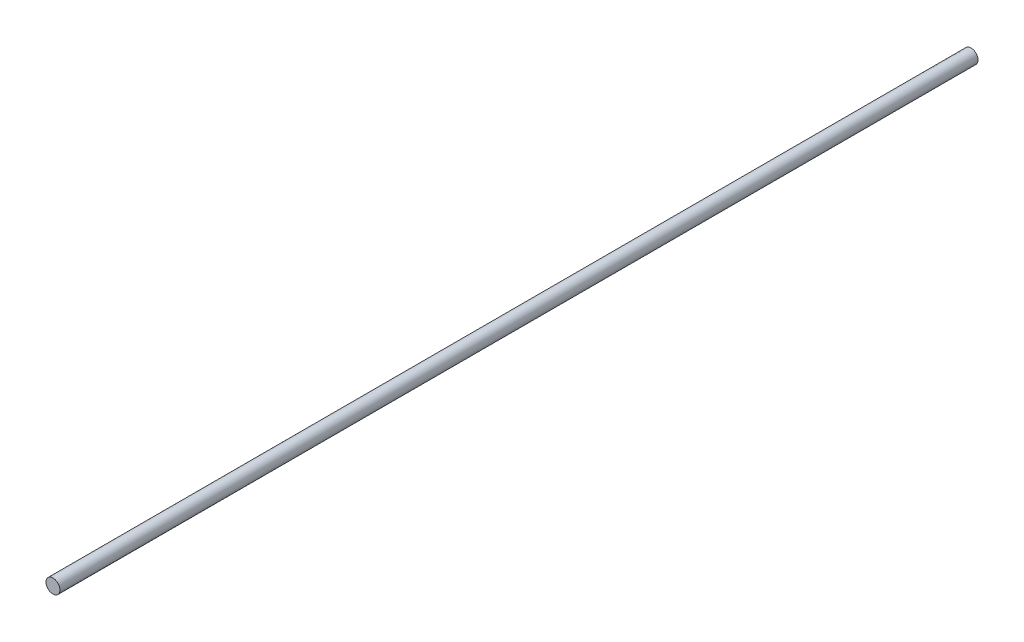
ISO-10303-21;
HEADER;
FILE_DESCRIPTION(('STEP AP214'),'2;1');
FILE_NAME('part.step','',(''),(''),'','','');
FILE_SCHEMA(('AUTOMOTIVE_DESIGN { 1 0 10303 214 1 1 1 1 }'));
ENDSEC;
DATA;
#1=APPLICATION_CONTEXT('core data for automotive mechanical design processes');
#2=APPLICATION_PROTOCOL_DEFINITION('international standard','automotive_design',2000,#1);
#3=PRODUCT_CONTEXT('',#1,'mechanical');
#4=PRODUCT('Part','Part','',(#3));
#5=PRODUCT_RELATED_PRODUCT_CATEGORY('part','',(#4));
#6=PRODUCT_DEFINITION_FORMATION('','',#4);
#7=PRODUCT_DEFINITION_CONTEXT('part definition',#1,'design');
#8=PRODUCT_DEFINITION('design','',#6,#7);
#9=PRODUCT_DEFINITION_SHAPE('','',#8);
#10=(LENGTH_UNIT() NAMED_UNIT(*) SI_UNIT(.MILLI.,.METRE.));
#11=(NAMED_UNIT(*) PLANE_ANGLE_UNIT() SI_UNIT($,.RADIAN.));
#12=(NAMED_UNIT(*) SI_UNIT($,.STERADIAN.) SOLID_ANGLE_UNIT());
#13=UNCERTAINTY_MEASURE_WITH_UNIT(LENGTH_MEASURE(1.E-05),#10,'distance_accuracy_value','');
#14=(GEOMETRIC_REPRESENTATION_CONTEXT(3) GLOBAL_UNCERTAINTY_ASSIGNED_CONTEXT((#13)) GLOBAL_UNIT_ASSIGNED_CONTEXT((#10,
#11,#12)) REPRESENTATION_CONTEXT('',''));
#15=CARTESIAN_POINT('',(0.,0.,0.));
#16=DIRECTION('',(0.,0.,1.));
#17=DIRECTION('',(1.,0.,0.));
#18=AXIS2_PLACEMENT_3D('',#15,#16,#17);
#19=CARTESIAN_POINT('',(0.,0.,-3950.));
#20=DIRECTION('',(0.,0.,1.));
#21=DIRECTION('',(1.,0.,0.));
#22=AXIS2_PLACEMENT_3D('',#19,#20,#21);
#23=CYLINDRICAL_SURFACE('',#22,30.);
#24=CARTESIAN_POINT('',(0.,0.,-3950.));
#25=DIRECTION('',(0.,0.,1.));
#26=DIRECTION('',(1.,0.,0.));
#27=AXIS2_PLACEMENT_3D('',#24,#25,#26);
#28=CIRCLE('',#27,30.);
#29=CARTESIAN_POINT('',(30.,0.,-3950.));
#30=VERTEX_POINT('',#29);
#31=EDGE_CURVE('E10',#30,#30,#28,.T.);
#32=CARTESIAN_POINT('',(0.,0.,0.));
#33=DIRECTION('',(0.,0.,1.));
#34=DIRECTION('',(1.,0.,0.));
#35=AXIS2_PLACEMENT_3D('',#32,#33,#34);
#36=CIRCLE('',#35,30.);
#37=CARTESIAN_POINT('',(30.,0.,-4.44089209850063E-13));
#38=VERTEX_POINT('',#37);
#39=EDGE_CURVE('E40',#38,#38,#36,.T.);
#40=CARTESIAN_POINT('',(30.,0.,-3950.));
#41=CARTESIAN_POINT('',(30.,0.,-3908.85416666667));
#42=CARTESIAN_POINT('',(30.,0.,-3867.70833333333));
#43=CARTESIAN_POINT('',(30.,0.,-3785.41666666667));
#44=CARTESIAN_POINT('',(30.,0.,-3744.27083333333));
#45=CARTESIAN_POINT('',(30.,0.,-3661.97916666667));
#46=CARTESIAN_POINT('',(30.,0.,-3620.83333333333));
#47=CARTESIAN_POINT('',(30.,0.,-3538.54166666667));
#48=CARTESIAN_POINT('',(30.,0.,-3497.39583333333));
#49=CARTESIAN_POINT('',(30.,0.,-3415.10416666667));
#50=CARTESIAN_POINT('',(30.,0.,-3373.95833333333));
#51=CARTESIAN_POINT('',(30.,0.,-3291.66666666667));
#52=CARTESIAN_POINT('',(30.,0.,-3250.52083333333));
#53=CARTESIAN_POINT('',(30.,0.,-3168.22916666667));
#54=CARTESIAN_POINT('',(30.,0.,-3127.08333333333));
#55=CARTESIAN_POINT('',(30.,0.,-3044.79166666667));
#56=CARTESIAN_POINT('',(30.,0.,-3003.64583333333));
#57=CARTESIAN_POINT('',(30.,0.,-2921.35416666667));
#58=CARTESIAN_POINT('',(30.,0.,-2880.20833333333));
#59=CARTESIAN_POINT('',(30.,0.,-2797.91666666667));
#60=CARTESIAN_POINT('',(30.,0.,-2756.77083333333));
#61=CARTESIAN_POINT('',(30.,0.,-2674.47916666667));
#62=CARTESIAN_POINT('',(30.,0.,-2633.33333333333));
#63=CARTESIAN_POINT('',(30.,0.,-2551.04166666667));
#64=CARTESIAN_POINT('',(30.,0.,-2509.89583333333));
#65=CARTESIAN_POINT('',(30.,0.,-2427.60416666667));
#66=CARTESIAN_POINT('',(30.,0.,-2386.45833333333));
#67=CARTESIAN_POINT('',(30.,0.,-2304.16666666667));
#68=CARTESIAN_POINT('',(30.,0.,-2263.02083333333));
#69=CARTESIAN_POINT('',(30.,0.,-2180.72916666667));
#70=CARTESIAN_POINT('',(30.,0.,-2139.58333333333));
#71=CARTESIAN_POINT('',(30.,0.,-2057.29166666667));
#72=CARTESIAN_POINT('',(30.,0.,-2016.14583333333));
#73=CARTESIAN_POINT('',(30.,0.,-1933.85416666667));
#74=CARTESIAN_POINT('',(30.,0.,-1892.70833333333));
#75=CARTESIAN_POINT('',(30.,0.,-1810.41666666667));
#76=CARTESIAN_POINT('',(30.,0.,-1769.27083333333));
#77=CARTESIAN_POINT('',(30.,0.,-1686.97916666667));
#78=CARTESIAN_POINT('',(30.,0.,-1645.83333333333));
#79=CARTESIAN_POINT('',(30.,0.,-1563.54166666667));
#80=CARTESIAN_POINT('',(30.,0.,-1522.39583333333));
#81=CARTESIAN_POINT('',(30.,0.,-1440.10416666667));
#82=CARTESIAN_POINT('',(30.,0.,-1398.95833333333));
#83=CARTESIAN_POINT('',(30.,0.,-1316.66666666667));
#84=CARTESIAN_POINT('',(30.,0.,-1275.52083333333));
#85=CARTESIAN_POINT('',(30.,0.,-1193.22916666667));
#86=CARTESIAN_POINT('',(30.,0.,-1152.08333333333));
#87=CARTESIAN_POINT('',(30.,0.,-1069.79166666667));
#88=CARTESIAN_POINT('',(30.,0.,-1028.64583333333));
#89=CARTESIAN_POINT('',(30.,0.,-946.354166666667));
#90=CARTESIAN_POINT('',(30.,0.,-905.208333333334));
#91=CARTESIAN_POINT('',(30.,0.,-822.916666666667));
#92=CARTESIAN_POINT('',(30.,0.,-781.770833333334));
#93=CARTESIAN_POINT('',(30.,0.,-699.479166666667));
#94=CARTESIAN_POINT('',(30.,0.,-658.333333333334));
#95=CARTESIAN_POINT('',(30.,0.,-576.041666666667));
#96=CARTESIAN_POINT('',(30.,0.,-534.895833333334));
#97=CARTESIAN_POINT('',(30.,0.,-452.604166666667));
#98=CARTESIAN_POINT('',(30.,0.,-411.458333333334));
#99=CARTESIAN_POINT('',(30.,0.,-329.166666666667));
#100=CARTESIAN_POINT('',(30.,0.,-288.020833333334));
#101=CARTESIAN_POINT('',(30.,0.,-205.729166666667));
#102=CARTESIAN_POINT('',(30.,0.,-164.583333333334));
#103=CARTESIAN_POINT('',(30.,0.,-82.2916666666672));
#104=CARTESIAN_POINT('',(30.,0.,-41.1458333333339));
#105=CARTESIAN_POINT('',(30.,0.,-4.44089209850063E-13));
#106=B_SPLINE_CURVE_WITH_KNOTS('',3,(#40,#41,#42,#43,#44,#45,#46,#47,#48,#49,#50,#51,#52,#53,
#54,#55,#56,#57,#58,#59,#60,#61,#62,#63,#64,#65,#66,#67,#68,#69,#70,#71,#72,#73,#74,#75,#76,#77,
#78,#79,#80,#81,#82,#83,#84,#85,#86,#87,#88,#89,#90,#91,#92,#93,#94,#95,#96,#97,#98,#99,#100,
#101,#102,#103,#104,#105),.UNSPECIFIED.,.F.,.F.,(4,2,2,2,2,2,2,2,2,2,2,2,2,2,2,2,2,2,2,2,2,2,2,
2,2,2,2,2,2,2,2,2,4),(0.,123.4375,246.875,370.3125,493.75,617.1875,740.625,864.0625,987.5,
1110.9375,1234.375,1357.8125,1481.25,1604.6875,1728.125,1851.5625,1975.,2098.4375,2221.875,
2345.3125,2468.75,2592.1875,2715.625,2839.0625,2962.5,3085.9375,3209.375,3332.8125,3456.25,
3579.6875,3703.125,3826.5625,3950.),.UNSPECIFIED.);
#107=EDGE_CURVE('BSEAM37',#30,#38,#106,.T.);
#108=ORIENTED_EDGE('',*,*,#31,.T.);
#109=ORIENTED_EDGE('',*,*,#39,.F.);
#110=ORIENTED_EDGE('',*,*,#107,.T.);
#111=ORIENTED_EDGE('',*,*,#107,.F.);
#112=EDGE_LOOP('',(#108,#110,#109,#111));
#113=FACE_BOUND('',#112,.T.);
#114=ADVANCED_FACE('F37',(#113),#23,.T.);
#115=CARTESIAN_POINT('',(0.,0.,-3950.));
#116=DIRECTION('',(0.,0.,1.));
#117=DIRECTION('',(1.,0.,0.));
#118=AXIS2_PLACEMENT_3D('',#115,#116,#117);
#119=PLANE('',#118);
#120=ORIENTED_EDGE('',*,*,#31,.F.);
#121=EDGE_LOOP('',(#120));
#122=FACE_BOUND('',#121,.T.);
#123=ADVANCED_FACE('F54',(#122),#119,.F.);
#124=CARTESIAN_POINT('',(0.,0.,0.));
#125=DIRECTION('',(0.,0.,1.));
#126=DIRECTION('',(1.,0.,0.));
#127=AXIS2_PLACEMENT_3D('',#124,#125,#126);
#128=PLANE('',#127);
#129=ORIENTED_EDGE('',*,*,#39,.T.);
#130=EDGE_LOOP('',(#129));
#131=FACE_BOUND('',#130,.T.);
#132=ADVANCED_FACE('F51',(#131),#128,.T.);
#133=CLOSED_SHELL('',(#114,#123,#132));
#134=MANIFOLD_SOLID_BREP('B2',#133);
#135=ADVANCED_BREP_SHAPE_REPRESENTATION('',(#18,#134),#14);
#136=SHAPE_DEFINITION_REPRESENTATION(#9,#135);
ENDSEC;
END-ISO-10303-21;
